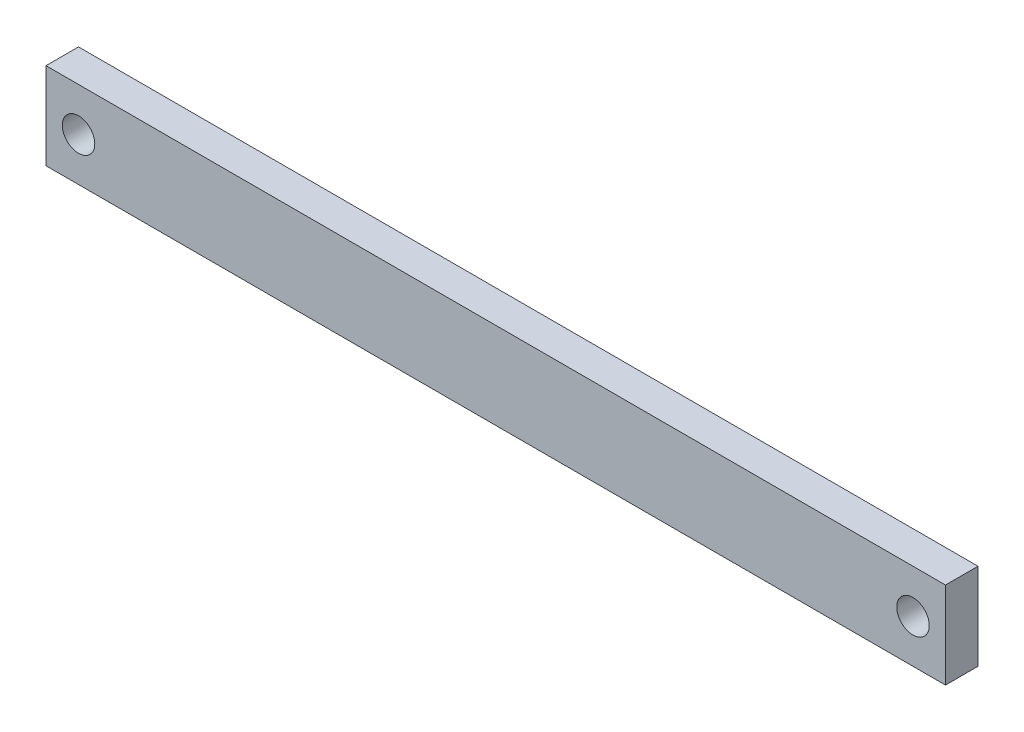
from build123d import *

# Parameters (mm, degrees)
ESQUISSE1_W      = 83
ESQUISSE1_H      = 8
ESQUISSE1_R      = 1.5
EXTRUSION1_DEPTH = 3


with BuildPart() as part:
    # Esquisse1 → Extrusion1 (new body)
    with BuildSketch(Plane.XY):
        with Locations((41.5, 4)):
            Rectangle(ESQUISSE1_W, ESQUISSE1_H)
        with Locations((3, 4)):
            Circle(ESQUISSE1_R, mode=Mode.SUBTRACT)
        with Locations((80, 4)):
            Circle(ESQUISSE1_R, mode=Mode.SUBTRACT)
    extrude(amount=EXTRUSION1_DEPTH)


solid = part.part
